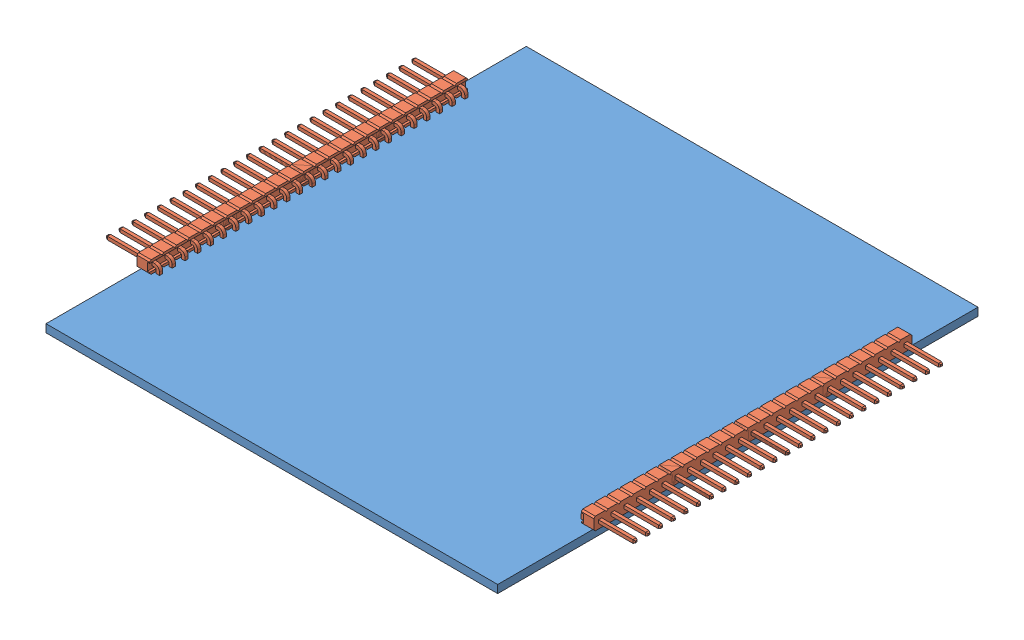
SolidWorks assembly RTD Power Relay dataModule.SLDASM, configuration Default (file format 3800). Lengths in mm.
Overall size (105.57 5.5 95.88).
9 component instances, 2 part files, 23 mates.
Components (placement in the parent):
- DM6952HR RTD Power Relay dataModule-1: DM6952HR RTD Power Relay dataModule.SLDPRT [Default] at origin size (90.17 1.59 95.88)
- SW3dPS-01 inch_right angle pin strip-1: SW3dPS-01 inch_right angle pin strip.SLDPRT [7 Way] at (1.9737 2.8575 -19.9763) x (0 0 1) z (0 1 0) size (17.78 10.72 5.5)
- SW3dPS-01 inch_right angle pin strip-2: SW3dPS-01 inch_right angle pin strip.SLDPRT [7 Way] at (1.9737 2.8575 -35.2163) x (0 0 1) z (0 1 0) size (17.78 10.72 5.5)
- SW3dPS-01 inch_right angle pin strip-3: SW3dPS-01 inch_right angle pin strip.SLDPRT [7 Way] at (1.9737 2.8575 -50.4563) x (0 0 1) z (0 1 0) size (17.78 10.72 5.5)
- SW3dPS-01 inch_right angle pin strip-4: SW3dPS-01 inch_right angle pin strip.SLDPRT [7 Way] at (1.9737 2.8575 -65.6963) x (0 0 1) z (0 1 0) size (17.78 10.72 5.5)
- SW3dPS-01 inch_right angle pin strip-5: SW3dPS-01 inch_right angle pin strip.SLDPRT [7 Way] at (88.1463 2.8575 -35.2163) x (0 0 -1) z (0 1 0) size (17.78 10.72 5.5)
- SW3dPS-01 inch_right angle pin strip-6: SW3dPS-01 inch_right angle pin strip.SLDPRT [7 Way] at (88.1463 2.8575 -50.4563) x (0 0 -1) z (0 1 0) size (17.78 10.72 5.5)
- SW3dPS-01 inch_right angle pin strip-7: SW3dPS-01 inch_right angle pin strip.SLDPRT [7 Way] at (88.1463 2.8575 -65.6963) x (0 0 -1) z (0 1 0) size (17.78 10.72 5.5)
- SW3dPS-01 inch_right angle pin strip-8: SW3dPS-01 inch_right angle pin strip.SLDPRT [7 Way] at (88.1463 2.8575 -80.9363) x (0 0 -1) z (0 1 0) size (17.78 10.72 5.5)
Mates (geometry in assembly coordinates):
- Coincident1: coincident aligned: plane of ?; plane of ?
- Coincident2: coincident aligned: plane of ?; plane of ?
- Coincident3: coincident aligned: plane of ?; plane of ?
- Coincident4: coincident aligned: plane of ?; plane of ?
- Coincident5: coincident aligned: plane of ?; plane of ?
- Coincident6: coincident aligned: plane of ?; plane of ?
- Coincident7: coincident aligned: plane of ?; plane of ?
- Coincident8: coincident aligned: plane of ?; plane of ?
- Coincident9: coincident aligned: plane of ?; plane of ?
- Coincident10: coincident anti-aligned: unknown of DM6952HR RTD Power Relay dataModule-1
- Parallel1: parallel anti-aligned: unknown of DM6952HR RTD Power Relay dataModule-1
- Coincident12: coincident aligned: plane of ?; plane of ?
- Parallel2: parallel aligned: unknown of DM6952HR RTD Power Relay dataModule-1
- Coincident14: coincident aligned: plane of ?; plane of ?
- Coincident15: coincident aligned: plane of ?; plane of ?
- Coincident16: coincident aligned: plane of ?; plane of ?
- Coincident17: coincident aligned: plane of ?; plane of ?
- Coincident18: coincident aligned: plane of ?; plane of ?
- Coincident19: coincident aligned: plane of ?; plane of ?
- Coincident20: coincident aligned: plane of ?; plane of ?
- Coincident21: coincident aligned: plane of ?; plane of ?
- Coincident22: coincident aligned: plane of ?; plane of ?
- Coincident23: coincident aligned: plane of ?; plane of ?
